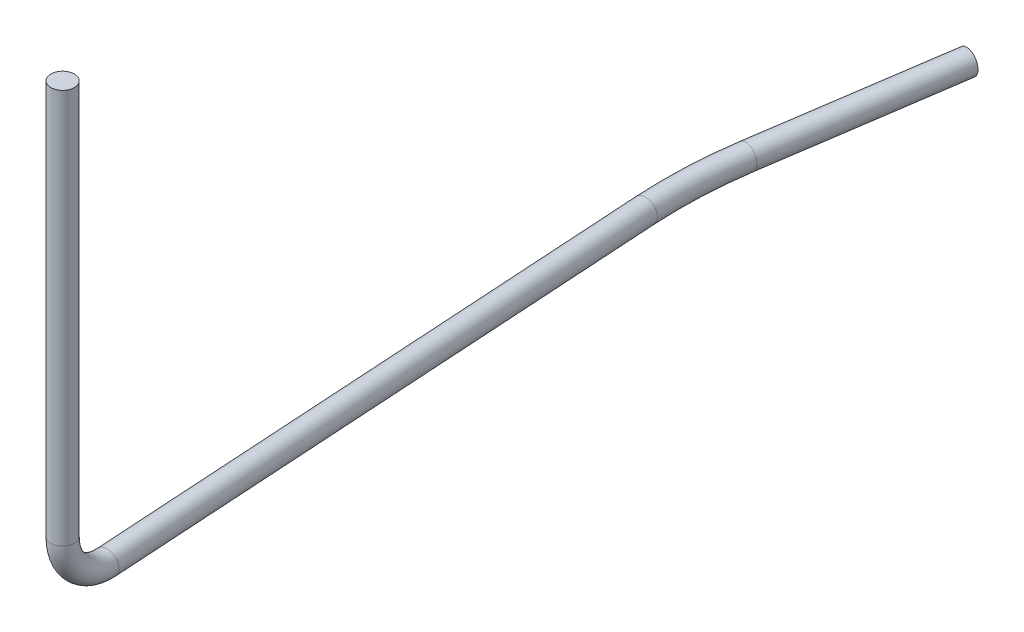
from build123d import *

# Parameters (mm, degrees)
ESQUISSE5_R = 0.25


with BuildPart() as part:
    # Balayage1: sweep along a curve in space
    with BuildLine() as balayage1_path:
        Line((4.927359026, 6, 8.48782928), (4.927359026, -2.4, 8.48782928))
        ThreePointArc((4.927359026, -2.4, 8.48782928), (4.909350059, -3.107106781, 8.195490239), (4.865872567, -3.4, 7.489721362))
        Line((4.865872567, -3.4, 7.489721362), (4.113842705, -3.4, -4.717957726))
        ThreePointArc((4.113842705, -3.4, -4.717957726), (4.104102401, -3.4, -5.761221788), (4.203111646, -3.4, -6.799822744))
        Line((4.203111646, -3.4, -6.799822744), (4.81078287, -3.4, -10.897277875))
    # Esquisse5 → Balayage1 (sweep)
    with BuildSketch(Plane(origin=(4.927359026, 6, 8.48782928), x_dir=(1, 0, 0), z_dir=(0, -1, 0))):
        Circle(ESQUISSE5_R)
    sweep(path=balayage1_path.line)


solid = part.part
